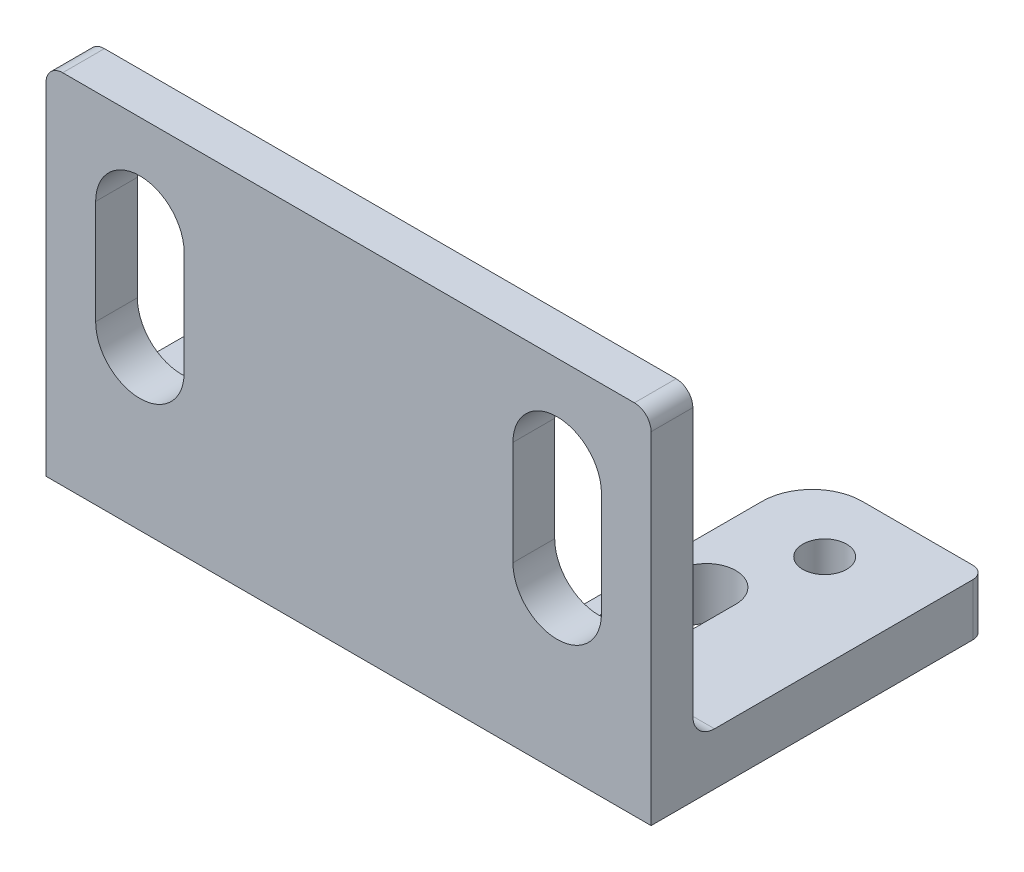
ISO-10303-21;
HEADER;
FILE_DESCRIPTION(('STEP AP214'),'2;1');
FILE_NAME('part.step','',(''),(''),'','','');
FILE_SCHEMA(('AUTOMOTIVE_DESIGN { 1 0 10303 214 1 1 1 1 }'));
ENDSEC;
DATA;
#1=APPLICATION_CONTEXT('core data for automotive mechanical design processes');
#2=APPLICATION_PROTOCOL_DEFINITION('international standard','automotive_design',2000,#1);
#3=PRODUCT_CONTEXT('',#1,'mechanical');
#4=PRODUCT('Part','Part','',(#3));
#5=PRODUCT_RELATED_PRODUCT_CATEGORY('part','',(#4));
#6=PRODUCT_DEFINITION_FORMATION('','',#4);
#7=PRODUCT_DEFINITION_CONTEXT('part definition',#1,'design');
#8=PRODUCT_DEFINITION('design','',#6,#7);
#9=PRODUCT_DEFINITION_SHAPE('','',#8);
#10=(LENGTH_UNIT() NAMED_UNIT(*) SI_UNIT(.MILLI.,.METRE.));
#11=(NAMED_UNIT(*) PLANE_ANGLE_UNIT() SI_UNIT($,.RADIAN.));
#12=(NAMED_UNIT(*) SI_UNIT($,.STERADIAN.) SOLID_ANGLE_UNIT());
#13=UNCERTAINTY_MEASURE_WITH_UNIT(LENGTH_MEASURE(1.E-05),#10,'distance_accuracy_value','');
#14=(GEOMETRIC_REPRESENTATION_CONTEXT(3) GLOBAL_UNCERTAINTY_ASSIGNED_CONTEXT((#13)) GLOBAL_UNIT_ASSIGNED_CONTEXT((#10,
#11,#12)) REPRESENTATION_CONTEXT('',''));
#15=CARTESIAN_POINT('',(0.,0.,0.));
#16=DIRECTION('',(0.,0.,1.));
#17=DIRECTION('',(1.,0.,0.));
#18=AXIS2_PLACEMENT_3D('',#15,#16,#17);
#19=CARTESIAN_POINT('',(0.,3.175,0.));
#20=DIRECTION('',(0.,1.,0.));
#21=DIRECTION('',(0.,0.,1.));
#22=AXIS2_PLACEMENT_3D('',#19,#20,#21);
#23=PLANE('',#22);
#24=CARTESIAN_POINT('',(-12.7,3.175,-12.8524));
#25=DIRECTION('',(0.,1.,0.));
#26=DIRECTION('',(0.,0.,1.));
#27=AXIS2_PLACEMENT_3D('',#24,#25,#26);
#28=CIRCLE('',#27,1.3335);
#29=CARTESIAN_POINT('',(-12.7,3.175,-11.5189));
#30=VERTEX_POINT('',#29);
#31=EDGE_CURVE('E356',#30,#30,#28,.T.);
#32=ORIENTED_EDGE('',*,*,#31,.F.);
#33=EDGE_LOOP('',(#32));
#34=FACE_BOUND('',#33,.T.);
#35=DIRECTION('',(-1.,0.,0.));
#36=VECTOR('',#35,1.);
#37=CARTESIAN_POINT('',(-18.415,3.175,-16.9164));
#38=LINE('',#37,#36);
#39=CARTESIAN_POINT('',(-10.922,3.175,-16.9164));
#40=VERTEX_POINT('',#39);
#41=CARTESIAN_POINT('',(-17.653,3.175,-16.9164));
#42=VERTEX_POINT('',#41);
#43=EDGE_CURVE('E511',#40,#42,#38,.T.);
#44=ORIENTED_EDGE('',*,*,#43,.T.);
#45=CARTESIAN_POINT('',(-17.653,3.175,-16.1544));
#46=DIRECTION('',(0.,1.,0.));
#47=DIRECTION('',(0.,0.,1.));
#48=AXIS2_PLACEMENT_3D('',#45,#46,#47);
#49=CIRCLE('',#48,0.762);
#50=CARTESIAN_POINT('',(-18.415,3.175,-16.1544));
#51=VERTEX_POINT('',#50);
#52=EDGE_CURVE('E550',#42,#51,#49,.T.);
#53=ORIENTED_EDGE('',*,*,#52,.T.);
#54=DIRECTION('',(0.,0.,1.));
#55=VECTOR('',#54,1.);
#56=CARTESIAN_POINT('',(-18.415,3.175,3.429));
#57=LINE('',#56,#55);
#58=CARTESIAN_POINT('',(-18.415,3.175,-0.431799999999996));
#59=VERTEX_POINT('',#58);
#60=EDGE_CURVE('E450',#51,#59,#57,.T.);
#61=ORIENTED_EDGE('',*,*,#60,.T.);
#62=DIRECTION('',(-1.,0.,0.));
#63=VECTOR('',#62,1.);
#64=CARTESIAN_POINT('',(0.,3.175,-0.431799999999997));
#65=LINE('',#64,#63);
#66=CARTESIAN_POINT('',(-7.79874009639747,3.175,-0.431799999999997));
#67=VERTEX_POINT('',#66);
#68=EDGE_CURVE('E380',#59,#67,#65,.F.);
#69=ORIENTED_EDGE('',*,*,#68,.T.);
#70=CARTESIAN_POINT('',(-7.112,3.175,-0.761999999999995));
#71=DIRECTION('',(0.,1.,0.));
#72=DIRECTION('',(0.,0.,1.));
#73=AXIS2_PLACEMENT_3D('',#70,#71,#72);
#74=CIRCLE('',#73,0.762);
#75=CARTESIAN_POINT('',(-7.874,3.175,-0.761999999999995));
#76=VERTEX_POINT('',#75);
#77=EDGE_CURVE('E482',#67,#76,#74,.F.);
#78=ORIENTED_EDGE('',*,*,#77,.T.);
#79=DIRECTION('',(0.,0.,-1.));
#80=VECTOR('',#79,1.);
#81=CARTESIAN_POINT('',(-7.874,3.175,-16.9164));
#82=LINE('',#81,#80);
#83=CARTESIAN_POINT('',(-7.874,3.175,-13.8684));
#84=VERTEX_POINT('',#83);
#85=EDGE_CURVE('E572',#76,#84,#82,.T.);
#86=ORIENTED_EDGE('',*,*,#85,.T.);
#87=CARTESIAN_POINT('',(-10.922,3.175,-13.8684));
#88=DIRECTION('',(0.,1.,0.));
#89=DIRECTION('',(0.,0.,1.));
#90=AXIS2_PLACEMENT_3D('',#87,#88,#89);
#91=CIRCLE('',#90,3.048);
#92=EDGE_CURVE('E419',#84,#40,#91,.T.);
#93=ORIENTED_EDGE('',*,*,#92,.T.);
#94=EDGE_LOOP('',(#44,#53,#61,#69,#78,#86,#93));
#95=FACE_BOUND('',#94,.T.);
#96=ADVANCED_FACE('F32',(#34,#95),#23,.T.);
#97=CARTESIAN_POINT('',(18.415,3.175,3.429));
#98=DIRECTION('',(-1.,0.,0.));
#99=DIRECTION('',(0.,0.,1.));
#100=AXIS2_PLACEMENT_3D('',#97,#98,#99);
#101=PLANE('',#100);
#102=DIRECTION('',(0.,0.,-1.));
#103=VECTOR('',#102,1.);
#104=CARTESIAN_POINT('',(18.415,0.,3.429));
#105=LINE('',#104,#103);
#106=CARTESIAN_POINT('',(18.415,0.,3.429));
#107=VERTEX_POINT('',#106);
#108=CARTESIAN_POINT('',(18.415,0.,-16.1544));
#109=VERTEX_POINT('',#108);
#110=EDGE_CURVE('E364',#107,#109,#105,.T.);
#111=ORIENTED_EDGE('',*,*,#110,.T.);
#112=DIRECTION('',(0.,-1.,0.));
#113=VECTOR('',#112,1.);
#114=CARTESIAN_POINT('',(18.415,3.175,-16.1544));
#115=LINE('',#114,#113);
#116=CARTESIAN_POINT('',(18.415,3.175,-16.1544));
#117=VERTEX_POINT('',#116);
#118=EDGE_CURVE('E40',#109,#117,#115,.F.);
#119=ORIENTED_EDGE('',*,*,#118,.T.);
#120=DIRECTION('',(0.,0.,-1.));
#121=VECTOR('',#120,1.);
#122=CARTESIAN_POINT('',(18.415,3.175,3.429));
#123=LINE('',#122,#121);
#124=CARTESIAN_POINT('',(18.415,3.175,-0.431799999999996));
#125=VERTEX_POINT('',#124);
#126=EDGE_CURVE('E372',#125,#117,#123,.T.);
#127=ORIENTED_EDGE('',*,*,#126,.F.);
#128=CARTESIAN_POINT('',(18.415,4.4958,-0.431799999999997));
#129=DIRECTION('',(-1.,0.,0.));
#130=DIRECTION('',(0.,0.,1.));
#131=AXIS2_PLACEMENT_3D('',#128,#129,#130);
#132=CIRCLE('',#131,1.3208);
#133=CARTESIAN_POINT('',(18.415,4.49580000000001,0.889000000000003));
#134=VERTEX_POINT('',#133);
#135=EDGE_CURVE('E388',#125,#134,#132,.T.);
#136=ORIENTED_EDGE('',*,*,#135,.T.);
#137=DIRECTION('',(0.,-1.,0.));
#138=VECTOR('',#137,1.);
#139=CARTESIAN_POINT('',(18.415,21.7805,0.889000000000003));
#140=LINE('',#139,#138);
#141=CARTESIAN_POINT('',(18.415,20.7645,0.889000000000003));
#142=VERTEX_POINT('',#141);
#143=EDGE_CURVE('E360',#142,#134,#140,.T.);
#144=ORIENTED_EDGE('',*,*,#143,.F.);
#145=DIRECTION('',(0.,0.,-1.));
#146=VECTOR('',#145,1.);
#147=CARTESIAN_POINT('',(18.415,20.7645,3.429));
#148=LINE('',#147,#146);
#149=CARTESIAN_POINT('',(18.415,20.7645,3.429));
#150=VERTEX_POINT('',#149);
#151=EDGE_CURVE('E927',#142,#150,#148,.F.);
#152=ORIENTED_EDGE('',*,*,#151,.T.);
#153=DIRECTION('',(0.,-1.,0.));
#154=VECTOR('',#153,1.);
#155=CARTESIAN_POINT('',(18.415,3.175,3.429));
#156=LINE('',#155,#154);
#157=EDGE_CURVE('E510',#150,#107,#156,.T.);
#158=ORIENTED_EDGE('',*,*,#157,.T.);
#159=EDGE_LOOP('',(#111,#119,#127,#136,#144,#152,#158));
#160=FACE_BOUND('',#159,.T.);
#161=ADVANCED_FACE('F545',(#160),#101,.F.);
#162=CARTESIAN_POINT('',(18.415,3.175,-16.9164));
#163=DIRECTION('',(0.,0.,1.));
#164=DIRECTION('',(1.,0.,0.));
#165=AXIS2_PLACEMENT_3D('',#162,#163,#164);
#166=PLANE('',#165);
#167=DIRECTION('',(-1.,0.,0.));
#168=VECTOR('',#167,1.);
#169=CARTESIAN_POINT('',(18.415,3.175,-16.9164));
#170=LINE('',#169,#168);
#171=CARTESIAN_POINT('',(17.653,3.175,-16.9164));
#172=VERTEX_POINT('',#171);
#173=CARTESIAN_POINT('',(10.922,3.175,-16.9164));
#174=VERTEX_POINT('',#173);
#175=EDGE_CURVE('E369',#172,#174,#170,.T.);
#176=ORIENTED_EDGE('',*,*,#175,.F.);
#177=DIRECTION('',(0.,-1.,0.));
#178=VECTOR('',#177,1.);
#179=CARTESIAN_POINT('',(17.653,3.175,-16.9164));
#180=LINE('',#179,#178);
#181=CARTESIAN_POINT('',(17.653,0.,-16.9164));
#182=VERTEX_POINT('',#181);
#183=EDGE_CURVE('E549',#172,#182,#180,.T.);
#184=ORIENTED_EDGE('',*,*,#183,.T.);
#185=DIRECTION('',(-1.,0.,0.));
#186=VECTOR('',#185,1.);
#187=CARTESIAN_POINT('',(18.415,0.,-16.9164));
#188=LINE('',#187,#186);
#189=CARTESIAN_POINT('',(10.922,0.,-16.9164));
#190=VERTEX_POINT('',#189);
#191=EDGE_CURVE('E518',#182,#190,#188,.T.);
#192=ORIENTED_EDGE('',*,*,#191,.T.);
#193=DIRECTION('',(0.,-1.,0.));
#194=VECTOR('',#193,1.);
#195=CARTESIAN_POINT('',(10.922,3.175,-16.9164));
#196=LINE('',#195,#194);
#197=EDGE_CURVE('E416',#190,#174,#196,.F.);
#198=ORIENTED_EDGE('',*,*,#197,.T.);
#199=EDGE_LOOP('',(#176,#184,#192,#198));
#200=FACE_BOUND('',#199,.T.);
#201=ADVANCED_FACE('F596',(#200),#166,.F.);
#202=CARTESIAN_POINT('',(7.874,3.175,-16.9164));
#203=DIRECTION('',(1.,0.,0.));
#204=DIRECTION('',(0.,0.,-1.));
#205=AXIS2_PLACEMENT_3D('',#202,#203,#204);
#206=PLANE('',#205);
#207=DIRECTION('',(0.,0.,1.));
#208=VECTOR('',#207,1.);
#209=CARTESIAN_POINT('',(7.874,0.,-16.9164));
#210=LINE('',#209,#208);
#211=CARTESIAN_POINT('',(7.874,0.,-13.8684));
#212=VERTEX_POINT('',#211);
#213=CARTESIAN_POINT('',(7.874,0.,-0.761999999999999));
#214=VERTEX_POINT('',#213);
#215=EDGE_CURVE('E520',#212,#214,#210,.T.);
#216=ORIENTED_EDGE('',*,*,#215,.T.);
#217=DIRECTION('',(0.,-1.,0.));
#218=VECTOR('',#217,1.);
#219=CARTESIAN_POINT('',(7.874,3.24757670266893,-0.762));
#220=LINE('',#219,#218);
#221=CARTESIAN_POINT('',(7.874,3.175,-0.761999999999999));
#222=VERTEX_POINT('',#221);
#223=EDGE_CURVE('E471',#214,#222,#220,.F.);
#224=ORIENTED_EDGE('',*,*,#223,.T.);
#225=DIRECTION('',(0.,0.,1.));
#226=VECTOR('',#225,1.);
#227=CARTESIAN_POINT('',(7.874,3.175,-16.9164));
#228=LINE('',#227,#226);
#229=CARTESIAN_POINT('',(7.874,3.175,-13.8684));
#230=VERTEX_POINT('',#229);
#231=EDGE_CURVE('E590',#230,#222,#228,.T.);
#232=ORIENTED_EDGE('',*,*,#231,.F.);
#233=DIRECTION('',(0.,-1.,0.));
#234=VECTOR('',#233,1.);
#235=CARTESIAN_POINT('',(7.874,3.175,-13.8684));
#236=LINE('',#235,#234);
#237=EDGE_CURVE('E406',#230,#212,#236,.T.);
#238=ORIENTED_EDGE('',*,*,#237,.T.);
#239=EDGE_LOOP('',(#216,#224,#232,#238));
#240=FACE_BOUND('',#239,.T.);
#241=ADVANCED_FACE('F586',(#240),#206,.F.);
#242=CARTESIAN_POINT('',(7.874,3.175,0.));
#243=DIRECTION('',(0.,0.,1.));
#244=DIRECTION('',(1.,0.,0.));
#245=AXIS2_PLACEMENT_3D('',#242,#243,#244);
#246=PLANE('',#245);
#247=DIRECTION('',(-1.,0.,0.));
#248=VECTOR('',#247,1.);
#249=CARTESIAN_POINT('',(7.874,0.,0.));
#250=LINE('',#249,#248);
#251=CARTESIAN_POINT('',(7.112,0.,0.));
#252=VERTEX_POINT('',#251);
#253=CARTESIAN_POINT('',(-7.112,0.,0.));
#254=VERTEX_POINT('',#253);
#255=EDGE_CURVE('E523',#252,#254,#250,.T.);
#256=ORIENTED_EDGE('',*,*,#255,.T.);
#257=DIRECTION('',(0.,-1.,0.));
#258=VECTOR('',#257,1.);
#259=CARTESIAN_POINT('',(-7.112,3.24757670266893,0.));
#260=LINE('',#259,#258);
#261=CARTESIAN_POINT('',(-7.112,3.24757670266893,0.));
#262=VERTEX_POINT('',#261);
#263=EDGE_CURVE('E469',#254,#262,#260,.F.);
#264=ORIENTED_EDGE('',*,*,#263,.T.);
#265=DIRECTION('',(-1.,0.,0.));
#266=VECTOR('',#265,1.);
#267=CARTESIAN_POINT('',(-7.874,3.24757670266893,0.));
#268=LINE('',#267,#266);
#269=CARTESIAN_POINT('',(7.112,3.24757670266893,0.));
#270=VERTEX_POINT('',#269);
#271=EDGE_CURVE('E385',#262,#270,#268,.F.);
#272=ORIENTED_EDGE('',*,*,#271,.T.);
#273=DIRECTION('',(0.,-1.,0.));
#274=VECTOR('',#273,1.);
#275=CARTESIAN_POINT('',(7.112,0.,0.));
#276=LINE('',#275,#274);
#277=EDGE_CURVE('E461',#270,#252,#276,.T.);
#278=ORIENTED_EDGE('',*,*,#277,.T.);
#279=EDGE_LOOP('',(#256,#264,#272,#278));
#280=FACE_BOUND('',#279,.T.);
#281=ADVANCED_FACE('F577',(#280),#246,.F.);
#282=CARTESIAN_POINT('',(-7.874,3.175,-16.9164));
#283=DIRECTION('',(-1.,0.,0.));
#284=DIRECTION('',(0.,0.,1.));
#285=AXIS2_PLACEMENT_3D('',#282,#283,#284);
#286=PLANE('',#285);
#287=ORIENTED_EDGE('',*,*,#85,.F.);
#288=DIRECTION('',(0.,-1.,0.));
#289=VECTOR('',#288,1.);
#290=CARTESIAN_POINT('',(-7.874,0.,-0.761999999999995));
#291=LINE('',#290,#289);
#292=CARTESIAN_POINT('',(-7.874,0.,-0.761999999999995));
#293=VERTEX_POINT('',#292);
#294=EDGE_CURVE('E457',#76,#293,#291,.T.);
#295=ORIENTED_EDGE('',*,*,#294,.T.);
#296=DIRECTION('',(0.,0.,-1.));
#297=VECTOR('',#296,1.);
#298=CARTESIAN_POINT('',(-7.874,0.,-16.9164));
#299=LINE('',#298,#297);
#300=CARTESIAN_POINT('',(-7.874,0.,-13.8684));
#301=VERTEX_POINT('',#300);
#302=EDGE_CURVE('E526',#293,#301,#299,.T.);
#303=ORIENTED_EDGE('',*,*,#302,.T.);
#304=DIRECTION('',(0.,-1.,0.));
#305=VECTOR('',#304,1.);
#306=CARTESIAN_POINT('',(-7.874,3.175,-13.8684));
#307=LINE('',#306,#305);
#308=EDGE_CURVE('E425',#301,#84,#307,.F.);
#309=ORIENTED_EDGE('',*,*,#308,.T.);
#310=EDGE_LOOP('',(#287,#295,#303,#309));
#311=FACE_BOUND('',#310,.T.);
#312=ADVANCED_FACE('F570',(#311),#286,.F.);
#313=CARTESIAN_POINT('',(-18.415,3.175,-16.9164));
#314=DIRECTION('',(0.,0.,1.));
#315=DIRECTION('',(1.,0.,0.));
#316=AXIS2_PLACEMENT_3D('',#313,#314,#315);
#317=PLANE('',#316);
#318=DIRECTION('',(-1.,0.,0.));
#319=VECTOR('',#318,1.);
#320=CARTESIAN_POINT('',(-18.415,0.,-16.9164));
#321=LINE('',#320,#319);
#322=CARTESIAN_POINT('',(-10.922,0.,-16.9164));
#323=VERTEX_POINT('',#322);
#324=CARTESIAN_POINT('',(-17.653,0.,-16.9164));
#325=VERTEX_POINT('',#324);
#326=EDGE_CURVE('E528',#323,#325,#321,.T.);
#327=ORIENTED_EDGE('',*,*,#326,.T.);
#328=DIRECTION('',(0.,-1.,0.));
#329=VECTOR('',#328,1.);
#330=CARTESIAN_POINT('',(-17.653,3.175,-16.9164));
#331=LINE('',#330,#329);
#332=EDGE_CURVE('E554',#325,#42,#331,.F.);
#333=ORIENTED_EDGE('',*,*,#332,.T.);
#334=ORIENTED_EDGE('',*,*,#43,.F.);
#335=DIRECTION('',(0.,-1.,0.));
#336=VECTOR('',#335,1.);
#337=CARTESIAN_POINT('',(-10.922,3.175,-16.9164));
#338=LINE('',#337,#336);
#339=EDGE_CURVE('E423',#40,#323,#338,.T.);
#340=ORIENTED_EDGE('',*,*,#339,.T.);
#341=EDGE_LOOP('',(#327,#333,#334,#340));
#342=FACE_BOUND('',#341,.T.);
#343=ADVANCED_FACE('F562',(#342),#317,.F.);
#344=CARTESIAN_POINT('',(-18.415,3.175,3.429));
#345=DIRECTION('',(1.,0.,0.));
#346=DIRECTION('',(0.,0.,-1.));
#347=AXIS2_PLACEMENT_3D('',#344,#345,#346);
#348=PLANE('',#347);
#349=ORIENTED_EDGE('',*,*,#60,.F.);
#350=DIRECTION('',(0.,-1.,0.));
#351=VECTOR('',#350,1.);
#352=CARTESIAN_POINT('',(-18.415,3.175,-16.1544));
#353=LINE('',#352,#351);
#354=CARTESIAN_POINT('',(-18.415,0.,-16.1544));
#355=VERTEX_POINT('',#354);
#356=EDGE_CURVE('E506',#51,#355,#353,.T.);
#357=ORIENTED_EDGE('',*,*,#356,.T.);
#358=DIRECTION('',(0.,0.,1.));
#359=VECTOR('',#358,1.);
#360=CARTESIAN_POINT('',(-18.415,0.,3.429));
#361=LINE('',#360,#359);
#362=CARTESIAN_POINT('',(-18.415,0.,3.429));
#363=VERTEX_POINT('',#362);
#364=EDGE_CURVE('E531',#355,#363,#361,.T.);
#365=ORIENTED_EDGE('',*,*,#364,.T.);
#366=DIRECTION('',(0.,-1.,0.));
#367=VECTOR('',#366,1.);
#368=CARTESIAN_POINT('',(-18.415,3.175,3.429));
#369=LINE('',#368,#367);
#370=CARTESIAN_POINT('',(-18.415,20.7645,3.429));
#371=VERTEX_POINT('',#370);
#372=EDGE_CURVE('E410',#371,#363,#369,.T.);
#373=ORIENTED_EDGE('',*,*,#372,.F.);
#374=DIRECTION('',(0.,0.,1.));
#375=VECTOR('',#374,1.);
#376=CARTESIAN_POINT('',(-18.415,20.7645,3.429));
#377=LINE('',#376,#375);
#378=CARTESIAN_POINT('',(-18.415,20.7645,0.889000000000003));
#379=VERTEX_POINT('',#378);
#380=EDGE_CURVE('E454',#371,#379,#377,.F.);
#381=ORIENTED_EDGE('',*,*,#380,.T.);
#382=DIRECTION('',(0.,-1.,0.));
#383=VECTOR('',#382,1.);
#384=CARTESIAN_POINT('',(-18.415,21.7805,0.889000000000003));
#385=LINE('',#384,#383);
#386=CARTESIAN_POINT('',(-18.415,4.49580000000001,0.889000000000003));
#387=VERTEX_POINT('',#386);
#388=EDGE_CURVE('E352',#379,#387,#385,.T.);
#389=ORIENTED_EDGE('',*,*,#388,.T.);
#390=CARTESIAN_POINT('',(-18.415,4.4958,-0.431799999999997));
#391=DIRECTION('',(1.,0.,0.));
#392=DIRECTION('',(0.,0.,-1.));
#393=AXIS2_PLACEMENT_3D('',#390,#391,#392);
#394=CIRCLE('',#393,1.3208);
#395=EDGE_CURVE('E382',#387,#59,#394,.T.);
#396=ORIENTED_EDGE('',*,*,#395,.T.);
#397=EDGE_LOOP('',(#349,#357,#365,#373,#381,#389,#396));
#398=FACE_BOUND('',#397,.T.);
#399=ADVANCED_FACE('F448',(#398),#348,.F.);
#400=CARTESIAN_POINT('',(-18.415,3.175,3.429));
#401=DIRECTION('',(0.,0.,-1.));
#402=DIRECTION('',(-1.,0.,0.));
#403=AXIS2_PLACEMENT_3D('',#400,#401,#402);
#404=PLANE('',#403);
#405=DIRECTION('',(0.,-1.,0.));
#406=VECTOR('',#405,1.);
#407=CARTESIAN_POINT('',(15.3924,9.652,3.429));
#408=LINE('',#407,#406);
#409=CARTESIAN_POINT('',(15.3924,16.002,3.429));
#410=VERTEX_POINT('',#409);
#411=CARTESIAN_POINT('',(15.3924,9.652,3.429));
#412=VERTEX_POINT('',#411);
#413=EDGE_CURVE('E293',#410,#412,#408,.T.);
#414=ORIENTED_EDGE('',*,*,#413,.T.);
#415=CARTESIAN_POINT('',(12.7,9.652,3.429));
#416=DIRECTION('',(0.,0.,-1.));
#417=DIRECTION('',(1.,0.,0.));
#418=AXIS2_PLACEMENT_3D('',#415,#416,#417);
#419=CIRCLE('',#418,2.6924);
#420=CARTESIAN_POINT('',(10.0076,9.652,3.429));
#421=VERTEX_POINT('',#420);
#422=EDGE_CURVE('E283',#412,#421,#419,.T.);
#423=ORIENTED_EDGE('',*,*,#422,.T.);
#424=DIRECTION('',(0.,1.,0.));
#425=VECTOR('',#424,1.);
#426=CARTESIAN_POINT('',(10.0076,9.652,3.429));
#427=LINE('',#426,#425);
#428=CARTESIAN_POINT('',(10.0076,16.002,3.429));
#429=VERTEX_POINT('',#428);
#430=EDGE_CURVE('E286',#421,#429,#427,.T.);
#431=ORIENTED_EDGE('',*,*,#430,.T.);
#432=CARTESIAN_POINT('',(12.7,16.002,3.429));
#433=DIRECTION('',(0.,0.,-1.));
#434=DIRECTION('',(1.,0.,0.));
#435=AXIS2_PLACEMENT_3D('',#432,#433,#434);
#436=CIRCLE('',#435,2.6924);
#437=EDGE_CURVE('E290',#429,#410,#436,.T.);
#438=ORIENTED_EDGE('',*,*,#437,.T.);
#439=EDGE_LOOP('',(#414,#423,#431,#438));
#440=FACE_BOUND('',#439,.T.);
#441=DIRECTION('',(0.,-1.,0.));
#442=VECTOR('',#441,1.);
#443=CARTESIAN_POINT('',(-10.0076,9.652,3.429));
#444=LINE('',#443,#442);
#445=CARTESIAN_POINT('',(-10.0076,16.002,3.429));
#446=VERTEX_POINT('',#445);
#447=CARTESIAN_POINT('',(-10.0076,9.652,3.429));
#448=VERTEX_POINT('',#447);
#449=EDGE_CURVE('E325',#446,#448,#444,.T.);
#450=ORIENTED_EDGE('',*,*,#449,.T.);
#451=CARTESIAN_POINT('',(-12.7,9.652,3.429));
#452=DIRECTION('',(0.,0.,-1.));
#453=DIRECTION('',(-1.,0.,0.));
#454=AXIS2_PLACEMENT_3D('',#451,#452,#453);
#455=CIRCLE('',#454,2.6924);
#456=CARTESIAN_POINT('',(-15.3924,9.652,3.429));
#457=VERTEX_POINT('',#456);
#458=EDGE_CURVE('E315',#448,#457,#455,.T.);
#459=ORIENTED_EDGE('',*,*,#458,.T.);
#460=DIRECTION('',(0.,1.,0.));
#461=VECTOR('',#460,1.);
#462=CARTESIAN_POINT('',(-15.3924,9.652,3.429));
#463=LINE('',#462,#461);
#464=CARTESIAN_POINT('',(-15.3924,16.002,3.429));
#465=VERTEX_POINT('',#464);
#466=EDGE_CURVE('E318',#457,#465,#463,.T.);
#467=ORIENTED_EDGE('',*,*,#466,.T.);
#468=CARTESIAN_POINT('',(-12.7,16.002,3.429));
#469=DIRECTION('',(0.,0.,-1.));
#470=DIRECTION('',(-1.,0.,0.));
#471=AXIS2_PLACEMENT_3D('',#468,#469,#470);
#472=CIRCLE('',#471,2.6924);
#473=EDGE_CURVE('E322',#465,#446,#472,.T.);
#474=ORIENTED_EDGE('',*,*,#473,.T.);
#475=EDGE_LOOP('',(#450,#459,#467,#474));
#476=FACE_BOUND('',#475,.T.);
#477=ORIENTED_EDGE('',*,*,#157,.F.);
#478=CARTESIAN_POINT('',(17.399,20.7645,3.429));
#479=DIRECTION('',(0.,0.,-1.));
#480=DIRECTION('',(-1.,0.,0.));
#481=AXIS2_PLACEMENT_3D('',#478,#479,#480);
#482=CIRCLE('',#481,1.016);
#483=CARTESIAN_POINT('',(17.399,21.7805,3.429));
#484=VERTEX_POINT('',#483);
#485=EDGE_CURVE('E458',#150,#484,#482,.F.);
#486=ORIENTED_EDGE('',*,*,#485,.T.);
#487=DIRECTION('',(1.,0.,0.));
#488=VECTOR('',#487,1.);
#489=CARTESIAN_POINT('',(-18.415,21.7805,3.429));
#490=LINE('',#489,#488);
#491=CARTESIAN_POINT('',(-17.399,21.7805,3.429));
#492=VERTEX_POINT('',#491);
#493=EDGE_CURVE('E340',#492,#484,#490,.T.);
#494=ORIENTED_EDGE('',*,*,#493,.F.);
#495=CARTESIAN_POINT('',(-17.399,20.7645,3.429));
#496=DIRECTION('',(0.,0.,-1.));
#497=DIRECTION('',(-1.,0.,0.));
#498=AXIS2_PLACEMENT_3D('',#495,#496,#497);
#499=CIRCLE('',#498,1.016);
#500=EDGE_CURVE('E463',#492,#371,#499,.F.);
#501=ORIENTED_EDGE('',*,*,#500,.T.);
#502=ORIENTED_EDGE('',*,*,#372,.T.);
#503=DIRECTION('',(1.,0.,0.));
#504=VECTOR('',#503,1.);
#505=CARTESIAN_POINT('',(-18.415,0.,3.429));
#506=LINE('',#505,#504);
#507=EDGE_CURVE('E375',#363,#107,#506,.T.);
#508=ORIENTED_EDGE('',*,*,#507,.T.);
#509=EDGE_LOOP('',(#477,#486,#494,#501,#502,#508));
#510=FACE_BOUND('',#509,.T.);
#511=ADVANCED_FACE('F538',(#440,#476,#510),#404,.F.);
#512=CARTESIAN_POINT('',(10.7188,3.175,-2.3114));
#513=DIRECTION('',(0.,1.,0.));
#514=DIRECTION('',(0.,0.,1.));
#515=AXIS2_PLACEMENT_3D('',#512,#513,#514);
#516=CIRCLE('',#515,1.778);
#517=CARTESIAN_POINT('',(8.9408,3.175,-2.3114));
#518=VERTEX_POINT('',#517);
#519=CARTESIAN_POINT('',(12.4968,3.175,-2.3114));
#520=VERTEX_POINT('',#519);
#521=EDGE_CURVE('E280',#518,#520,#516,.T.);
#522=ORIENTED_EDGE('',*,*,#521,.F.);
#523=DIRECTION('',(0.,0.,1.));
#524=VECTOR('',#523,1.);
#525=CARTESIAN_POINT('',(8.9408,3.175,0.));
#526=LINE('',#525,#524);
#527=CARTESIAN_POINT('',(8.9408,3.175,-7.6454));
#528=VERTEX_POINT('',#527);
#529=EDGE_CURVE('E273',#528,#518,#526,.T.);
#530=ORIENTED_EDGE('',*,*,#529,.F.);
#531=CARTESIAN_POINT('',(10.7188,3.175,-7.6454));
#532=DIRECTION('',(0.,1.,0.));
#533=DIRECTION('',(0.,0.,1.));
#534=AXIS2_PLACEMENT_3D('',#531,#532,#533);
#535=CIRCLE('',#534,1.778);
#536=CARTESIAN_POINT('',(12.4968,3.175,-7.6454));
#537=VERTEX_POINT('',#536);
#538=EDGE_CURVE('E248',#537,#528,#535,.T.);
#539=ORIENTED_EDGE('',*,*,#538,.F.);
#540=DIRECTION('',(0.,0.,-1.));
#541=VECTOR('',#540,1.);
#542=CARTESIAN_POINT('',(12.4968,3.175,0.));
#543=LINE('',#542,#541);
#544=EDGE_CURVE('E278',#520,#537,#543,.T.);
#545=ORIENTED_EDGE('',*,*,#544,.F.);
#546=EDGE_LOOP('',(#522,#530,#539,#545));
#547=FACE_BOUND('',#546,.T.);
#548=ORIENTED_EDGE('',*,*,#126,.T.);
#549=CARTESIAN_POINT('',(17.653,3.175,-16.1544));
#550=DIRECTION('',(0.,1.,0.));
#551=DIRECTION('',(0.,0.,1.));
#552=AXIS2_PLACEMENT_3D('',#549,#550,#551);
#553=CIRCLE('',#552,0.762);
#554=EDGE_CURVE('E11',#117,#172,#553,.T.);
#555=ORIENTED_EDGE('',*,*,#554,.T.);
#556=ORIENTED_EDGE('',*,*,#175,.T.);
#557=CARTESIAN_POINT('',(10.922,3.175,-13.8684));
#558=DIRECTION('',(0.,1.,0.));
#559=DIRECTION('',(0.,0.,1.));
#560=AXIS2_PLACEMENT_3D('',#557,#558,#559);
#561=CIRCLE('',#560,3.048);
#562=EDGE_CURVE('E421',#174,#230,#561,.T.);
#563=ORIENTED_EDGE('',*,*,#562,.T.);
#564=ORIENTED_EDGE('',*,*,#231,.T.);
#565=CARTESIAN_POINT('',(7.112,3.175,-0.762));
#566=DIRECTION('',(0.,1.,0.));
#567=DIRECTION('',(0.,0.,1.));
#568=AXIS2_PLACEMENT_3D('',#565,#566,#567);
#569=CIRCLE('',#568,0.762);
#570=CARTESIAN_POINT('',(7.79874009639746,3.175,-0.431799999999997));
#571=VERTEX_POINT('',#570);
#572=EDGE_CURVE('E507',#222,#571,#569,.F.);
#573=ORIENTED_EDGE('',*,*,#572,.T.);
#574=DIRECTION('',(-1.,0.,0.));
#575=VECTOR('',#574,1.);
#576=CARTESIAN_POINT('',(0.,3.175,-0.431799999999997));
#577=LINE('',#576,#575);
#578=EDGE_CURVE('E378',#571,#125,#577,.F.);
#579=ORIENTED_EDGE('',*,*,#578,.T.);
#580=EDGE_LOOP('',(#548,#555,#556,#563,#564,#573,#579));
#581=FACE_BOUND('',#580,.T.);
#582=CARTESIAN_POINT('',(12.7,3.175,-12.8524));
#583=DIRECTION('',(0.,1.,0.));
#584=DIRECTION('',(0.,0.,-1.));
#585=AXIS2_PLACEMENT_3D('',#582,#583,#584);
#586=CIRCLE('',#585,1.3335);
#587=CARTESIAN_POINT('',(12.7,3.175,-14.1859));
#588=VERTEX_POINT('',#587);
#589=EDGE_CURVE('E357',#588,#588,#586,.T.);
#590=ORIENTED_EDGE('',*,*,#589,.F.);
#591=EDGE_LOOP('',(#590));
#592=FACE_BOUND('',#591,.T.);
#593=ADVANCED_FACE('F601',(#547,#581,#592),#23,.T.);
#594=CARTESIAN_POINT('',(0.,0.,0.));
#595=DIRECTION('',(0.,1.,0.));
#596=DIRECTION('',(0.,0.,1.));
#597=AXIS2_PLACEMENT_3D('',#594,#595,#596);
#598=PLANE('',#597);
#599=DIRECTION('',(0.,0.,-1.));
#600=VECTOR('',#599,1.);
#601=CARTESIAN_POINT('',(8.9408,0.,-2.3114));
#602=LINE('',#601,#600);
#603=CARTESIAN_POINT('',(8.9408,0.,-2.3114));
#604=VERTEX_POINT('',#603);
#605=CARTESIAN_POINT('',(8.9408,0.,-7.6454));
#606=VERTEX_POINT('',#605);
#607=EDGE_CURVE('E256',#604,#606,#602,.T.);
#608=ORIENTED_EDGE('',*,*,#607,.F.);
#609=CARTESIAN_POINT('',(10.7188,0.,-2.3114));
#610=DIRECTION('',(0.,-1.,0.));
#611=DIRECTION('',(0.,0.,-1.));
#612=AXIS2_PLACEMENT_3D('',#609,#610,#611);
#613=CIRCLE('',#612,1.778);
#614=CARTESIAN_POINT('',(12.4968,0.,-2.3114));
#615=VERTEX_POINT('',#614);
#616=EDGE_CURVE('E261',#615,#604,#613,.T.);
#617=ORIENTED_EDGE('',*,*,#616,.F.);
#618=DIRECTION('',(0.,0.,1.));
#619=VECTOR('',#618,1.);
#620=CARTESIAN_POINT('',(12.4968,0.,-2.3114));
#621=LINE('',#620,#619);
#622=CARTESIAN_POINT('',(12.4968,0.,-7.6454));
#623=VERTEX_POINT('',#622);
#624=EDGE_CURVE('E266',#623,#615,#621,.T.);
#625=ORIENTED_EDGE('',*,*,#624,.F.);
#626=CARTESIAN_POINT('',(10.7188,0.,-7.6454));
#627=DIRECTION('',(0.,-1.,0.));
#628=DIRECTION('',(0.,0.,-1.));
#629=AXIS2_PLACEMENT_3D('',#626,#627,#628);
#630=CIRCLE('',#629,1.778);
#631=EDGE_CURVE('E245',#606,#623,#630,.T.);
#632=ORIENTED_EDGE('',*,*,#631,.F.);
#633=EDGE_LOOP('',(#608,#617,#625,#632));
#634=FACE_BOUND('',#633,.T.);
#635=CARTESIAN_POINT('',(12.7,0.,-12.8524));
#636=DIRECTION('',(0.,1.,0.));
#637=DIRECTION('',(0.,0.,-1.));
#638=AXIS2_PLACEMENT_3D('',#635,#636,#637);
#639=CIRCLE('',#638,1.3335);
#640=CARTESIAN_POINT('',(12.7,0.,-14.1859));
#641=VERTEX_POINT('',#640);
#642=EDGE_CURVE('E353',#641,#641,#639,.T.);
#643=ORIENTED_EDGE('',*,*,#642,.T.);
#644=EDGE_LOOP('',(#643));
#645=FACE_BOUND('',#644,.T.);
#646=CARTESIAN_POINT('',(-12.7,0.,-12.8524));
#647=DIRECTION('',(0.,1.,0.));
#648=DIRECTION('',(0.,0.,1.));
#649=AXIS2_PLACEMENT_3D('',#646,#647,#648);
#650=CIRCLE('',#649,1.3335);
#651=CARTESIAN_POINT('',(-12.7,0.,-11.5189));
#652=VERTEX_POINT('',#651);
#653=EDGE_CURVE('E361',#652,#652,#650,.T.);
#654=ORIENTED_EDGE('',*,*,#653,.T.);
#655=EDGE_LOOP('',(#654));
#656=FACE_BOUND('',#655,.T.);
#657=ORIENTED_EDGE('',*,*,#364,.F.);
#658=CARTESIAN_POINT('',(-17.653,0.,-16.1544));
#659=DIRECTION('',(0.,1.,0.));
#660=DIRECTION('',(0.,0.,1.));
#661=AXIS2_PLACEMENT_3D('',#658,#659,#660);
#662=CIRCLE('',#661,0.762);
#663=EDGE_CURVE('E556',#355,#325,#662,.F.);
#664=ORIENTED_EDGE('',*,*,#663,.T.);
#665=ORIENTED_EDGE('',*,*,#326,.F.);
#666=CARTESIAN_POINT('',(-10.922,0.,-13.8684));
#667=DIRECTION('',(0.,1.,0.));
#668=DIRECTION('',(0.,0.,1.));
#669=AXIS2_PLACEMENT_3D('',#666,#667,#668);
#670=CIRCLE('',#669,3.048);
#671=EDGE_CURVE('E409',#323,#301,#670,.F.);
#672=ORIENTED_EDGE('',*,*,#671,.T.);
#673=ORIENTED_EDGE('',*,*,#302,.F.);
#674=CARTESIAN_POINT('',(-7.112,0.,-0.761999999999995));
#675=DIRECTION('',(0.,1.,0.));
#676=DIRECTION('',(0.,0.,1.));
#677=AXIS2_PLACEMENT_3D('',#674,#675,#676);
#678=CIRCLE('',#677,0.762);
#679=EDGE_CURVE('E473',#293,#254,#678,.T.);
#680=ORIENTED_EDGE('',*,*,#679,.T.);
#681=ORIENTED_EDGE('',*,*,#255,.F.);
#682=CARTESIAN_POINT('',(7.112,0.,-0.762));
#683=DIRECTION('',(0.,1.,0.));
#684=DIRECTION('',(0.,0.,1.));
#685=AXIS2_PLACEMENT_3D('',#682,#683,#684);
#686=CIRCLE('',#685,0.762);
#687=EDGE_CURVE('E583',#252,#214,#686,.T.);
#688=ORIENTED_EDGE('',*,*,#687,.T.);
#689=ORIENTED_EDGE('',*,*,#215,.F.);
#690=CARTESIAN_POINT('',(10.922,0.,-13.8684));
#691=DIRECTION('',(0.,1.,0.));
#692=DIRECTION('',(0.,0.,1.));
#693=AXIS2_PLACEMENT_3D('',#690,#691,#692);
#694=CIRCLE('',#693,3.048);
#695=EDGE_CURVE('E413',#212,#190,#694,.F.);
#696=ORIENTED_EDGE('',*,*,#695,.T.);
#697=ORIENTED_EDGE('',*,*,#191,.F.);
#698=CARTESIAN_POINT('',(17.653,0.,-16.1544));
#699=DIRECTION('',(0.,1.,0.));
#700=DIRECTION('',(0.,0.,1.));
#701=AXIS2_PLACEMENT_3D('',#698,#699,#700);
#702=CIRCLE('',#701,0.762);
#703=EDGE_CURVE('E544',#182,#109,#702,.F.);
#704=ORIENTED_EDGE('',*,*,#703,.T.);
#705=ORIENTED_EDGE('',*,*,#110,.F.);
#706=ORIENTED_EDGE('',*,*,#507,.F.);
#707=EDGE_LOOP('',(#657,#664,#665,#672,#673,#680,#681,#688,#689,#696,#697,#704,#705,#706));
#708=FACE_BOUND('',#707,.T.);
#709=ADVANCED_FACE('F263',(#634,#645,#656,#708),#598,.F.);
#710=CARTESIAN_POINT('',(-12.7,0.,-12.8524));
#711=DIRECTION('',(0.,1.,0.));
#712=DIRECTION('',(0.,0.,1.));
#713=AXIS2_PLACEMENT_3D('',#710,#711,#712);
#714=CYLINDRICAL_SURFACE('',#713,1.3335);
#715=ORIENTED_EDGE('',*,*,#653,.F.);
#716=EDGE_LOOP('',(#715));
#717=FACE_BOUND('',#716,.T.);
#718=ORIENTED_EDGE('',*,*,#31,.T.);
#719=EDGE_LOOP('',(#718));
#720=FACE_BOUND('',#719,.T.);
#721=ADVANCED_FACE('F615',(#717,#720),#714,.F.);
#722=CARTESIAN_POINT('',(12.7,0.,-12.8524));
#723=DIRECTION('',(0.,1.,0.));
#724=DIRECTION('',(0.,0.,1.));
#725=AXIS2_PLACEMENT_3D('',#722,#723,#724);
#726=CYLINDRICAL_SURFACE('',#725,1.3335);
#727=ORIENTED_EDGE('',*,*,#642,.F.);
#728=EDGE_LOOP('',(#727));
#729=FACE_BOUND('',#728,.T.);
#730=ORIENTED_EDGE('',*,*,#589,.T.);
#731=EDGE_LOOP('',(#730));
#732=FACE_BOUND('',#731,.T.);
#733=ADVANCED_FACE('F623',(#729,#732),#726,.F.);
#734=CARTESIAN_POINT('',(-18.415,21.7805,0.889000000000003));
#735=DIRECTION('',(0.,0.,1.));
#736=DIRECTION('',(1.,0.,0.));
#737=AXIS2_PLACEMENT_3D('',#734,#735,#736);
#738=PLANE('',#737);
#739=DIRECTION('',(0.,1.,0.));
#740=VECTOR('',#739,1.);
#741=CARTESIAN_POINT('',(10.0076,9.652,0.889000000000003));
#742=LINE('',#741,#740);
#743=CARTESIAN_POINT('',(10.0076,9.652,0.889000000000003));
#744=VERTEX_POINT('',#743);
#745=CARTESIAN_POINT('',(10.0076,16.002,0.889000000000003));
#746=VERTEX_POINT('',#745);
#747=EDGE_CURVE('E298',#744,#746,#742,.T.);
#748=ORIENTED_EDGE('',*,*,#747,.F.);
#749=CARTESIAN_POINT('',(12.7,9.652,0.889000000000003));
#750=DIRECTION('',(0.,0.,-1.));
#751=DIRECTION('',(1.,0.,0.));
#752=AXIS2_PLACEMENT_3D('',#749,#750,#751);
#753=CIRCLE('',#752,2.6924);
#754=CARTESIAN_POINT('',(15.3924,9.652,0.889000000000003));
#755=VERTEX_POINT('',#754);
#756=EDGE_CURVE('E282',#755,#744,#753,.T.);
#757=ORIENTED_EDGE('',*,*,#756,.F.);
#758=DIRECTION('',(0.,-1.,0.));
#759=VECTOR('',#758,1.);
#760=CARTESIAN_POINT('',(15.3924,9.652,0.889000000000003));
#761=LINE('',#760,#759);
#762=CARTESIAN_POINT('',(15.3924,16.002,0.889000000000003));
#763=VERTEX_POINT('',#762);
#764=EDGE_CURVE('E287',#763,#755,#761,.T.);
#765=ORIENTED_EDGE('',*,*,#764,.F.);
#766=CARTESIAN_POINT('',(12.7,16.002,0.889000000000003));
#767=DIRECTION('',(0.,0.,-1.));
#768=DIRECTION('',(1.,0.,0.));
#769=AXIS2_PLACEMENT_3D('',#766,#767,#768);
#770=CIRCLE('',#769,2.6924);
#771=EDGE_CURVE('E301',#746,#763,#770,.T.);
#772=ORIENTED_EDGE('',*,*,#771,.F.);
#773=EDGE_LOOP('',(#748,#757,#765,#772));
#774=FACE_BOUND('',#773,.T.);
#775=DIRECTION('',(0.,1.,0.));
#776=VECTOR('',#775,1.);
#777=CARTESIAN_POINT('',(-15.3924,9.652,0.889000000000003));
#778=LINE('',#777,#776);
#779=CARTESIAN_POINT('',(-15.3924,9.652,0.889000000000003));
#780=VERTEX_POINT('',#779);
#781=CARTESIAN_POINT('',(-15.3924,16.002,0.889000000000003));
#782=VERTEX_POINT('',#781);
#783=EDGE_CURVE('E330',#780,#782,#778,.T.);
#784=ORIENTED_EDGE('',*,*,#783,.F.);
#785=CARTESIAN_POINT('',(-12.7,9.652,0.889000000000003));
#786=DIRECTION('',(0.,0.,-1.));
#787=DIRECTION('',(-1.,0.,0.));
#788=AXIS2_PLACEMENT_3D('',#785,#786,#787);
#789=CIRCLE('',#788,2.6924);
#790=CARTESIAN_POINT('',(-10.0076,9.652,0.889000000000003));
#791=VERTEX_POINT('',#790);
#792=EDGE_CURVE('E308',#791,#780,#789,.T.);
#793=ORIENTED_EDGE('',*,*,#792,.F.);
#794=DIRECTION('',(0.,-1.,0.));
#795=VECTOR('',#794,1.);
#796=CARTESIAN_POINT('',(-10.0076,9.652,0.889000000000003));
#797=LINE('',#796,#795);
#798=CARTESIAN_POINT('',(-10.0076,16.002,0.889000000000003));
#799=VERTEX_POINT('',#798);
#800=EDGE_CURVE('E319',#799,#791,#797,.T.);
#801=ORIENTED_EDGE('',*,*,#800,.F.);
#802=CARTESIAN_POINT('',(-12.7,16.002,0.889000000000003));
#803=DIRECTION('',(0.,0.,-1.));
#804=DIRECTION('',(-1.,0.,0.));
#805=AXIS2_PLACEMENT_3D('',#802,#803,#804);
#806=CIRCLE('',#805,2.6924);
#807=EDGE_CURVE('E333',#782,#799,#806,.T.);
#808=ORIENTED_EDGE('',*,*,#807,.F.);
#809=EDGE_LOOP('',(#784,#793,#801,#808));
#810=FACE_BOUND('',#809,.T.);
#811=DIRECTION('',(-1.,0.,0.));
#812=VECTOR('',#811,1.);
#813=CARTESIAN_POINT('',(-18.415,21.7805,0.889000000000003));
#814=LINE('',#813,#812);
#815=CARTESIAN_POINT('',(17.399,21.7805,0.889000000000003));
#816=VERTEX_POINT('',#815);
#817=CARTESIAN_POINT('',(-17.399,21.7805,0.889000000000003));
#818=VERTEX_POINT('',#817);
#819=EDGE_CURVE('E349',#816,#818,#814,.T.);
#820=ORIENTED_EDGE('',*,*,#819,.F.);
#821=CARTESIAN_POINT('',(17.399,20.7645,0.889000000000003));
#822=DIRECTION('',(0.,0.,1.));
#823=DIRECTION('',(1.,0.,0.));
#824=AXIS2_PLACEMENT_3D('',#821,#822,#823);
#825=CIRCLE('',#824,1.016);
#826=EDGE_CURVE('E926',#816,#142,#825,.F.);
#827=ORIENTED_EDGE('',*,*,#826,.T.);
#828=ORIENTED_EDGE('',*,*,#143,.T.);
#829=DIRECTION('',(-1.,0.,0.));
#830=VECTOR('',#829,1.);
#831=CARTESIAN_POINT('',(-18.415,4.4958,0.889000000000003));
#832=LINE('',#831,#830);
#833=EDGE_CURVE('E376',#134,#387,#832,.T.);
#834=ORIENTED_EDGE('',*,*,#833,.T.);
#835=ORIENTED_EDGE('',*,*,#388,.F.);
#836=CARTESIAN_POINT('',(-17.399,20.7645,0.889000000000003));
#837=DIRECTION('',(0.,0.,1.));
#838=DIRECTION('',(1.,0.,0.));
#839=AXIS2_PLACEMENT_3D('',#836,#837,#838);
#840=CIRCLE('',#839,1.016);
#841=EDGE_CURVE('E397',#379,#818,#840,.F.);
#842=ORIENTED_EDGE('',*,*,#841,.T.);
#843=EDGE_LOOP('',(#820,#827,#828,#834,#835,#842));
#844=FACE_BOUND('',#843,.T.);
#845=ADVANCED_FACE('F436',(#774,#810,#844),#738,.F.);
#846=CARTESIAN_POINT('',(0.,21.7805,0.));
#847=DIRECTION('',(0.,-1.,0.));
#848=DIRECTION('',(0.,0.,-1.));
#849=AXIS2_PLACEMENT_3D('',#846,#847,#848);
#850=PLANE('',#849);
#851=ORIENTED_EDGE('',*,*,#493,.T.);
#852=DIRECTION('',(0.,0.,-1.));
#853=VECTOR('',#852,1.);
#854=CARTESIAN_POINT('',(17.399,21.7805,0.));
#855=LINE('',#854,#853);
#856=EDGE_CURVE('E394',#484,#816,#855,.T.);
#857=ORIENTED_EDGE('',*,*,#856,.T.);
#858=ORIENTED_EDGE('',*,*,#819,.T.);
#859=DIRECTION('',(0.,0.,1.));
#860=VECTOR('',#859,1.);
#861=CARTESIAN_POINT('',(-17.399,21.7805,0.));
#862=LINE('',#861,#860);
#863=EDGE_CURVE('E391',#818,#492,#862,.T.);
#864=ORIENTED_EDGE('',*,*,#863,.T.);
#865=EDGE_LOOP('',(#851,#857,#858,#864));
#866=FACE_BOUND('',#865,.T.);
#867=ADVANCED_FACE('F631',(#866),#850,.F.);
#868=CARTESIAN_POINT('',(-12.7,9.652,3.429));
#869=DIRECTION('',(0.,0.,-1.));
#870=DIRECTION('',(-1.,0.,0.));
#871=AXIS2_PLACEMENT_3D('',#868,#869,#870);
#872=CYLINDRICAL_SURFACE('',#871,2.6924);
#873=ORIENTED_EDGE('',*,*,#792,.T.);
#874=DIRECTION('',(0.,0.,-1.));
#875=VECTOR('',#874,1.);
#876=CARTESIAN_POINT('',(-15.3924,9.652,3.429));
#877=LINE('',#876,#875);
#878=EDGE_CURVE('E328',#457,#780,#877,.T.);
#879=ORIENTED_EDGE('',*,*,#878,.F.);
#880=ORIENTED_EDGE('',*,*,#458,.F.);
#881=DIRECTION('',(0.,0.,-1.));
#882=VECTOR('',#881,1.);
#883=CARTESIAN_POINT('',(-10.0076,9.652,3.429));
#884=LINE('',#883,#882);
#885=EDGE_CURVE('E338',#448,#791,#884,.T.);
#886=ORIENTED_EDGE('',*,*,#885,.T.);
#887=EDGE_LOOP('',(#873,#879,#880,#886));
#888=FACE_BOUND('',#887,.T.);
#889=ADVANCED_FACE('F639',(#888),#872,.F.);
#890=CARTESIAN_POINT('',(-10.0076,9.652,3.429));
#891=DIRECTION('',(1.,0.,0.));
#892=DIRECTION('',(0.,0.,-1.));
#893=AXIS2_PLACEMENT_3D('',#890,#891,#892);
#894=PLANE('',#893);
#895=ORIENTED_EDGE('',*,*,#800,.T.);
#896=ORIENTED_EDGE('',*,*,#885,.F.);
#897=ORIENTED_EDGE('',*,*,#449,.F.);
#898=DIRECTION('',(0.,0.,-1.));
#899=VECTOR('',#898,1.);
#900=CARTESIAN_POINT('',(-10.0076,16.002,3.429));
#901=LINE('',#900,#899);
#902=EDGE_CURVE('E341',#446,#799,#901,.T.);
#903=ORIENTED_EDGE('',*,*,#902,.T.);
#904=EDGE_LOOP('',(#895,#896,#897,#903));
#905=FACE_BOUND('',#904,.T.);
#906=ADVANCED_FACE('F643',(#905),#894,.F.);
#907=CARTESIAN_POINT('',(-12.7,16.002,3.429));
#908=DIRECTION('',(0.,0.,-1.));
#909=DIRECTION('',(-1.,0.,0.));
#910=AXIS2_PLACEMENT_3D('',#907,#908,#909);
#911=CYLINDRICAL_SURFACE('',#910,2.6924);
#912=ORIENTED_EDGE('',*,*,#807,.T.);
#913=ORIENTED_EDGE('',*,*,#902,.F.);
#914=ORIENTED_EDGE('',*,*,#473,.F.);
#915=DIRECTION('',(0.,0.,-1.));
#916=VECTOR('',#915,1.);
#917=CARTESIAN_POINT('',(-15.3924,16.002,3.429));
#918=LINE('',#917,#916);
#919=EDGE_CURVE('E343',#465,#782,#918,.T.);
#920=ORIENTED_EDGE('',*,*,#919,.T.);
#921=EDGE_LOOP('',(#912,#913,#914,#920));
#922=FACE_BOUND('',#921,.T.);
#923=ADVANCED_FACE('F649',(#922),#911,.F.);
#924=CARTESIAN_POINT('',(-15.3924,9.652,3.429));
#925=DIRECTION('',(-1.,0.,0.));
#926=DIRECTION('',(0.,0.,1.));
#927=AXIS2_PLACEMENT_3D('',#924,#925,#926);
#928=PLANE('',#927);
#929=ORIENTED_EDGE('',*,*,#783,.T.);
#930=ORIENTED_EDGE('',*,*,#919,.F.);
#931=ORIENTED_EDGE('',*,*,#466,.F.);
#932=ORIENTED_EDGE('',*,*,#878,.T.);
#933=EDGE_LOOP('',(#929,#930,#931,#932));
#934=FACE_BOUND('',#933,.T.);
#935=ADVANCED_FACE('F645',(#934),#928,.F.);
#936=CARTESIAN_POINT('',(12.7,9.652,3.429));
#937=DIRECTION('',(0.,0.,-1.));
#938=DIRECTION('',(-1.,0.,0.));
#939=AXIS2_PLACEMENT_3D('',#936,#937,#938);
#940=CYLINDRICAL_SURFACE('',#939,2.6924);
#941=ORIENTED_EDGE('',*,*,#756,.T.);
#942=DIRECTION('',(0.,0.,-1.));
#943=VECTOR('',#942,1.);
#944=CARTESIAN_POINT('',(10.0076,9.652,3.429));
#945=LINE('',#944,#943);
#946=EDGE_CURVE('E296',#421,#744,#945,.T.);
#947=ORIENTED_EDGE('',*,*,#946,.F.);
#948=ORIENTED_EDGE('',*,*,#422,.F.);
#949=DIRECTION('',(0.,0.,-1.));
#950=VECTOR('',#949,1.);
#951=CARTESIAN_POINT('',(15.3924,9.652,3.429));
#952=LINE('',#951,#950);
#953=EDGE_CURVE('E306',#412,#755,#952,.T.);
#954=ORIENTED_EDGE('',*,*,#953,.T.);
#955=EDGE_LOOP('',(#941,#947,#948,#954));
#956=FACE_BOUND('',#955,.T.);
#957=ADVANCED_FACE('F648',(#956),#940,.F.);
#958=CARTESIAN_POINT('',(15.3924,9.652,3.429));
#959=DIRECTION('',(1.,0.,0.));
#960=DIRECTION('',(0.,0.,-1.));
#961=AXIS2_PLACEMENT_3D('',#958,#959,#960);
#962=PLANE('',#961);
#963=ORIENTED_EDGE('',*,*,#764,.T.);
#964=ORIENTED_EDGE('',*,*,#953,.F.);
#965=ORIENTED_EDGE('',*,*,#413,.F.);
#966=DIRECTION('',(0.,0.,-1.));
#967=VECTOR('',#966,1.);
#968=CARTESIAN_POINT('',(15.3924,16.002,3.429));
#969=LINE('',#968,#967);
#970=EDGE_CURVE('E309',#410,#763,#969,.T.);
#971=ORIENTED_EDGE('',*,*,#970,.T.);
#972=EDGE_LOOP('',(#963,#964,#965,#971));
#973=FACE_BOUND('',#972,.T.);
#974=ADVANCED_FACE('F659',(#973),#962,.F.);
#975=CARTESIAN_POINT('',(12.7,16.002,3.429));
#976=DIRECTION('',(0.,0.,-1.));
#977=DIRECTION('',(-1.,0.,0.));
#978=AXIS2_PLACEMENT_3D('',#975,#976,#977);
#979=CYLINDRICAL_SURFACE('',#978,2.6924);
#980=ORIENTED_EDGE('',*,*,#771,.T.);
#981=ORIENTED_EDGE('',*,*,#970,.F.);
#982=ORIENTED_EDGE('',*,*,#437,.F.);
#983=DIRECTION('',(0.,0.,-1.));
#984=VECTOR('',#983,1.);
#985=CARTESIAN_POINT('',(10.0076,16.002,3.429));
#986=LINE('',#985,#984);
#987=EDGE_CURVE('E311',#429,#746,#986,.T.);
#988=ORIENTED_EDGE('',*,*,#987,.T.);
#989=EDGE_LOOP('',(#980,#981,#982,#988));
#990=FACE_BOUND('',#989,.T.);
#991=ADVANCED_FACE('F664',(#990),#979,.F.);
#992=CARTESIAN_POINT('',(10.0076,9.652,3.429));
#993=DIRECTION('',(-1.,0.,0.));
#994=DIRECTION('',(0.,0.,1.));
#995=AXIS2_PLACEMENT_3D('',#992,#993,#994);
#996=PLANE('',#995);
#997=ORIENTED_EDGE('',*,*,#747,.T.);
#998=ORIENTED_EDGE('',*,*,#987,.F.);
#999=ORIENTED_EDGE('',*,*,#430,.F.);
#1000=ORIENTED_EDGE('',*,*,#946,.T.);
#1001=EDGE_LOOP('',(#997,#998,#999,#1000));
#1002=FACE_BOUND('',#1001,.T.);
#1003=ADVANCED_FACE('F661',(#1002),#996,.F.);
#1004=CARTESIAN_POINT('',(10.922,3.175,-13.8684));
#1005=DIRECTION('',(0.,-1.,0.));
#1006=DIRECTION('',(0.,0.,-1.));
#1007=AXIS2_PLACEMENT_3D('',#1004,#1005,#1006);
#1008=CYLINDRICAL_SURFACE('',#1007,3.048);
#1009=ORIENTED_EDGE('',*,*,#562,.F.);
#1010=ORIENTED_EDGE('',*,*,#197,.F.);
#1011=ORIENTED_EDGE('',*,*,#695,.F.);
#1012=ORIENTED_EDGE('',*,*,#237,.F.);
#1013=EDGE_LOOP('',(#1009,#1010,#1011,#1012));
#1014=FACE_BOUND('',#1013,.T.);
#1015=ADVANCED_FACE('F593',(#1014),#1008,.T.);
#1016=CARTESIAN_POINT('',(-10.922,3.175,-13.8684));
#1017=DIRECTION('',(0.,-1.,0.));
#1018=DIRECTION('',(0.,0.,-1.));
#1019=AXIS2_PLACEMENT_3D('',#1016,#1017,#1018);
#1020=CYLINDRICAL_SURFACE('',#1019,3.048);
#1021=ORIENTED_EDGE('',*,*,#92,.F.);
#1022=ORIENTED_EDGE('',*,*,#308,.F.);
#1023=ORIENTED_EDGE('',*,*,#671,.F.);
#1024=ORIENTED_EDGE('',*,*,#339,.F.);
#1025=EDGE_LOOP('',(#1021,#1022,#1023,#1024));
#1026=FACE_BOUND('',#1025,.T.);
#1027=ADVANCED_FACE('F567',(#1026),#1020,.T.);
#1028=CARTESIAN_POINT('',(-18.415,4.4958,-0.431799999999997));
#1029=DIRECTION('',(-1.,0.,0.));
#1030=DIRECTION('',(0.,0.,1.));
#1031=AXIS2_PLACEMENT_3D('',#1028,#1029,#1030);
#1032=CYLINDRICAL_SURFACE('',#1031,1.3208);
#1033=ORIENTED_EDGE('',*,*,#271,.F.);
#1034=CARTESIAN_POINT('',(-7.112,3.24757670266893,0.));
#1035=CARTESIAN_POINT('',(-7.13296719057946,3.24758022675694,5.94877739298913E-07));
#1036=CARTESIAN_POINT('',(-7.15392345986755,3.2472768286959,-0.00086593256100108));
#1037=CARTESIAN_POINT('',(-7.19567053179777,3.24608930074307,-0.00431803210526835));
#1038=CARTESIAN_POINT('',(-7.21646138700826,3.24520536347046,-0.00690303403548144));
#1039=CARTESIAN_POINT('',(-7.27821813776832,3.24174178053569,-0.0171849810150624));
#1040=CARTESIAN_POINT('',(-7.31874647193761,3.23834982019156,-0.0274091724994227));
#1041=CARTESIAN_POINT('',(-7.39738825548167,3.23003762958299,-0.0542387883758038));
#1042=CARTESIAN_POINT('',(-7.43550377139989,3.22511872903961,-0.0708386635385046));
#1043=CARTESIAN_POINT('',(-7.50852093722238,3.21464702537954,-0.1099783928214));
#1044=CARTESIAN_POINT('',(-7.54341838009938,3.20909341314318,-0.132525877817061));
#1045=CARTESIAN_POINT('',(-7.61033473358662,3.19818923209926,-0.183940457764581));
#1046=CARTESIAN_POINT('',(-7.64220174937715,3.19285351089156,-0.213008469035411));
#1047=CARTESIAN_POINT('',(-7.70063992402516,3.1838104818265,-0.276211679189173));
#1048=CARTESIAN_POINT('',(-7.72722264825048,3.18009959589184,-0.310335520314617));
#1049=CARTESIAN_POINT('',(-7.75964210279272,3.17687227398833,-0.360164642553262));
#1050=CARTESIAN_POINT('',(-7.76810508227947,3.17618234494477,-0.374137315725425));
#1051=CARTESIAN_POINT('',(-7.78411448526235,3.17524633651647,-0.402595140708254));
#1052=CARTESIAN_POINT('',(-7.79166175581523,3.17499984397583,-0.417079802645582));
#1053=CARTESIAN_POINT('',(-7.79874009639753,3.17499999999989,-0.431799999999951));
#1054=B_SPLINE_CURVE_WITH_KNOTS('',3,(#1034,#1035,#1036,#1037,#1038,#1039,#1040,#1041,#1042,
#1043,#1044,#1045,#1046,#1047,#1048,#1049,#1050,#1051,#1052,#1053),.UNSPECIFIED.,.F.,.F.,(4,2,2,
2,2,2,2,2,2,4),(0.,0.0628602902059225,0.125699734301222,0.250851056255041,0.375893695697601,
0.501097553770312,0.630879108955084,0.760373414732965,0.809392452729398,0.858365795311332),.UNSPECIFIED.);
#1055=EDGE_CURVE('E475',#262,#67,#1054,.T.);
#1056=ORIENTED_EDGE('',*,*,#1055,.T.);
#1057=ORIENTED_EDGE('',*,*,#68,.F.);
#1058=ORIENTED_EDGE('',*,*,#395,.F.);
#1059=ORIENTED_EDGE('',*,*,#833,.F.);
#1060=ORIENTED_EDGE('',*,*,#135,.F.);
#1061=ORIENTED_EDGE('',*,*,#578,.F.);
#1062=CARTESIAN_POINT('',(7.79874009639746,3.175,-0.431799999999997));
#1063=CARTESIAN_POINT('',(7.78061940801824,3.17497411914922,-0.394031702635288));
#1064=CARTESIAN_POINT('',(7.75936128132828,3.17661917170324,-0.357865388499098));
#1065=CARTESIAN_POINT('',(7.71140926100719,3.18222954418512,-0.289699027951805));
#1066=CARTESIAN_POINT('',(7.68473321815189,3.18618732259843,-0.257685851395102));
#1067=CARTESIAN_POINT('',(7.62670683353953,3.19540659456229,-0.198582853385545));
#1068=CARTESIAN_POINT('',(7.59536458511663,3.20066584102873,-0.171484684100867));
#1069=CARTESIAN_POINT('',(7.52870512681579,3.21143526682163,-0.122698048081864));
#1070=CARTESIAN_POINT('',(7.49338353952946,3.21694571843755,-0.101015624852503));
#1071=CARTESIAN_POINT('',(7.41799833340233,3.22742803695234,-0.0628059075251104));
#1072=CARTESIAN_POINT('',(7.37779536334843,3.23236610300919,-0.046543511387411));
#1073=CARTESIAN_POINT('',(7.29508258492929,3.24041602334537,-0.0210621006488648));
#1074=CARTESIAN_POINT('',(7.25257737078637,3.2435313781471,-0.0118295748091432));
#1075=CARTESIAN_POINT('',(7.19341664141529,3.24613551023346,-0.00418524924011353));
#1076=CARTESIAN_POINT('',(7.1771673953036,3.24667436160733,-0.00261588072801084));
#1077=CARTESIAN_POINT('',(7.14461469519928,3.24739497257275,-0.000524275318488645));
#1078=CARTESIAN_POINT('',(7.12831133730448,3.24757718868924,-6.9969523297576E-07));
#1079=CARTESIAN_POINT('',(7.112,3.24757670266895,0.));
#1080=B_SPLINE_CURVE_WITH_KNOTS('',3,(#1062,#1063,#1064,#1065,#1066,#1067,#1068,#1069,#1070,
#1071,#1072,#1073,#1074,#1075,#1076,#1077,#1078,#1079),.UNSPECIFIED.,.F.,.F.,(4,2,2,2,2,2,2,2,
4),(0.,0.125372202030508,0.250337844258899,0.375089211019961,0.499979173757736,
0.630295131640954,0.760359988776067,0.809331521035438,0.858240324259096),.UNSPECIFIED.);
#1081=EDGE_CURVE('E500',#571,#270,#1080,.T.);
#1082=ORIENTED_EDGE('',*,*,#1081,.T.);
#1083=EDGE_LOOP('',(#1033,#1056,#1057,#1058,#1059,#1060,#1061,#1082));
#1084=FACE_BOUND('',#1083,.T.);
#1085=ADVANCED_FACE('F443',(#1084),#1032,.F.);
#1086=CARTESIAN_POINT('',(10.7188,21.7805,-2.3114));
#1087=DIRECTION('',(0.,-1.,0.));
#1088=DIRECTION('',(0.,0.,-1.));
#1089=AXIS2_PLACEMENT_3D('',#1086,#1087,#1088);
#1090=CYLINDRICAL_SURFACE('',#1089,1.778);
#1091=ORIENTED_EDGE('',*,*,#521,.T.);
#1092=DIRECTION('',(0.,-1.,0.));
#1093=VECTOR('',#1092,1.);
#1094=CARTESIAN_POINT('',(12.4968,21.7805,-2.3114));
#1095=LINE('',#1094,#1093);
#1096=EDGE_CURVE('E271',#520,#615,#1095,.T.);
#1097=ORIENTED_EDGE('',*,*,#1096,.T.);
#1098=ORIENTED_EDGE('',*,*,#616,.T.);
#1099=DIRECTION('',(0.,-1.,0.));
#1100=VECTOR('',#1099,1.);
#1101=CARTESIAN_POINT('',(8.9408,21.7805,-2.3114));
#1102=LINE('',#1101,#1100);
#1103=EDGE_CURVE('E252',#518,#604,#1102,.T.);
#1104=ORIENTED_EDGE('',*,*,#1103,.F.);
#1105=EDGE_LOOP('',(#1091,#1097,#1098,#1104));
#1106=FACE_BOUND('',#1105,.T.);
#1107=ADVANCED_FACE('F672',(#1106),#1090,.F.);
#1108=CARTESIAN_POINT('',(12.4968,21.7805,-2.3114));
#1109=DIRECTION('',(1.,0.,0.));
#1110=DIRECTION('',(0.,0.,-1.));
#1111=AXIS2_PLACEMENT_3D('',#1108,#1109,#1110);
#1112=PLANE('',#1111);
#1113=ORIENTED_EDGE('',*,*,#544,.T.);
#1114=DIRECTION('',(0.,-1.,0.));
#1115=VECTOR('',#1114,1.);
#1116=CARTESIAN_POINT('',(12.4968,21.7805,-7.6454));
#1117=LINE('',#1116,#1115);
#1118=EDGE_CURVE('E251',#537,#623,#1117,.T.);
#1119=ORIENTED_EDGE('',*,*,#1118,.T.);
#1120=ORIENTED_EDGE('',*,*,#624,.T.);
#1121=ORIENTED_EDGE('',*,*,#1096,.F.);
#1122=EDGE_LOOP('',(#1113,#1119,#1120,#1121));
#1123=FACE_BOUND('',#1122,.T.);
#1124=ADVANCED_FACE('F675',(#1123),#1112,.F.);
#1125=CARTESIAN_POINT('',(10.7188,21.7805,-7.6454));
#1126=DIRECTION('',(0.,-1.,0.));
#1127=DIRECTION('',(0.,0.,-1.));
#1128=AXIS2_PLACEMENT_3D('',#1125,#1126,#1127);
#1129=CYLINDRICAL_SURFACE('',#1128,1.778);
#1130=ORIENTED_EDGE('',*,*,#538,.T.);
#1131=DIRECTION('',(0.,-1.,0.));
#1132=VECTOR('',#1131,1.);
#1133=CARTESIAN_POINT('',(8.9408,21.7805,-7.6454));
#1134=LINE('',#1133,#1132);
#1135=EDGE_CURVE('E240',#528,#606,#1134,.T.);
#1136=ORIENTED_EDGE('',*,*,#1135,.T.);
#1137=ORIENTED_EDGE('',*,*,#631,.T.);
#1138=ORIENTED_EDGE('',*,*,#1118,.F.);
#1139=EDGE_LOOP('',(#1130,#1136,#1137,#1138));
#1140=FACE_BOUND('',#1139,.T.);
#1141=ADVANCED_FACE('F242',(#1140),#1129,.F.);
#1142=CARTESIAN_POINT('',(8.9408,21.7805,-2.3114));
#1143=DIRECTION('',(-1.,0.,0.));
#1144=DIRECTION('',(0.,0.,1.));
#1145=AXIS2_PLACEMENT_3D('',#1142,#1143,#1144);
#1146=PLANE('',#1145);
#1147=ORIENTED_EDGE('',*,*,#529,.T.);
#1148=ORIENTED_EDGE('',*,*,#1103,.T.);
#1149=ORIENTED_EDGE('',*,*,#607,.T.);
#1150=ORIENTED_EDGE('',*,*,#1135,.F.);
#1151=EDGE_LOOP('',(#1147,#1148,#1149,#1150));
#1152=FACE_BOUND('',#1151,.T.);
#1153=ADVANCED_FACE('F257',(#1152),#1146,.F.);
#1154=CARTESIAN_POINT('',(17.399,20.7645,0.));
#1155=DIRECTION('',(0.,0.,-1.));
#1156=DIRECTION('',(-1.,0.,0.));
#1157=AXIS2_PLACEMENT_3D('',#1154,#1155,#1156);
#1158=CYLINDRICAL_SURFACE('',#1157,1.016);
#1159=ORIENTED_EDGE('',*,*,#485,.F.);
#1160=ORIENTED_EDGE('',*,*,#151,.F.);
#1161=ORIENTED_EDGE('',*,*,#826,.F.);
#1162=ORIENTED_EDGE('',*,*,#856,.F.);
#1163=EDGE_LOOP('',(#1159,#1160,#1161,#1162));
#1164=FACE_BOUND('',#1163,.T.);
#1165=ADVANCED_FACE('F679',(#1164),#1158,.T.);
#1166=CARTESIAN_POINT('',(-17.399,20.7645,0.));
#1167=DIRECTION('',(0.,0.,1.));
#1168=DIRECTION('',(1.,0.,0.));
#1169=AXIS2_PLACEMENT_3D('',#1166,#1167,#1168);
#1170=CYLINDRICAL_SURFACE('',#1169,1.016);
#1171=ORIENTED_EDGE('',*,*,#841,.F.);
#1172=ORIENTED_EDGE('',*,*,#380,.F.);
#1173=ORIENTED_EDGE('',*,*,#500,.F.);
#1174=ORIENTED_EDGE('',*,*,#863,.F.);
#1175=EDGE_LOOP('',(#1171,#1172,#1173,#1174));
#1176=FACE_BOUND('',#1175,.T.);
#1177=ADVANCED_FACE('F493',(#1176),#1170,.T.);
#1178=CARTESIAN_POINT('',(-7.112,3.175,-0.761999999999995));
#1179=DIRECTION('',(0.,1.,0.));
#1180=DIRECTION('',(0.,0.,1.));
#1181=AXIS2_PLACEMENT_3D('',#1178,#1179,#1180);
#1182=CYLINDRICAL_SURFACE('',#1181,0.762);
#1183=ORIENTED_EDGE('',*,*,#1055,.F.);
#1184=ORIENTED_EDGE('',*,*,#263,.F.);
#1185=ORIENTED_EDGE('',*,*,#679,.F.);
#1186=ORIENTED_EDGE('',*,*,#294,.F.);
#1187=ORIENTED_EDGE('',*,*,#77,.F.);
#1188=EDGE_LOOP('',(#1183,#1184,#1185,#1186,#1187));
#1189=FACE_BOUND('',#1188,.T.);
#1190=ADVANCED_FACE('F487',(#1189),#1182,.F.);
#1191=CARTESIAN_POINT('',(7.112,3.175,-0.762));
#1192=DIRECTION('',(0.,1.,0.));
#1193=DIRECTION('',(0.,0.,1.));
#1194=AXIS2_PLACEMENT_3D('',#1191,#1192,#1193);
#1195=CYLINDRICAL_SURFACE('',#1194,0.762);
#1196=ORIENTED_EDGE('',*,*,#572,.F.);
#1197=ORIENTED_EDGE('',*,*,#223,.F.);
#1198=ORIENTED_EDGE('',*,*,#687,.F.);
#1199=ORIENTED_EDGE('',*,*,#277,.F.);
#1200=ORIENTED_EDGE('',*,*,#1081,.F.);
#1201=EDGE_LOOP('',(#1196,#1197,#1198,#1199,#1200));
#1202=FACE_BOUND('',#1201,.T.);
#1203=ADVANCED_FACE('F492',(#1202),#1195,.F.);
#1204=CARTESIAN_POINT('',(-17.653,3.175,-16.1544));
#1205=DIRECTION('',(0.,-1.,0.));
#1206=DIRECTION('',(0.,0.,-1.));
#1207=AXIS2_PLACEMENT_3D('',#1204,#1205,#1206);
#1208=CYLINDRICAL_SURFACE('',#1207,0.762);
#1209=ORIENTED_EDGE('',*,*,#52,.F.);
#1210=ORIENTED_EDGE('',*,*,#332,.F.);
#1211=ORIENTED_EDGE('',*,*,#663,.F.);
#1212=ORIENTED_EDGE('',*,*,#356,.F.);
#1213=EDGE_LOOP('',(#1209,#1210,#1211,#1212));
#1214=FACE_BOUND('',#1213,.T.);
#1215=ADVANCED_FACE('F497',(#1214),#1208,.T.);
#1216=CARTESIAN_POINT('',(17.653,3.175,-16.1544));
#1217=DIRECTION('',(0.,-1.,0.));
#1218=DIRECTION('',(0.,0.,-1.));
#1219=AXIS2_PLACEMENT_3D('',#1216,#1217,#1218);
#1220=CYLINDRICAL_SURFACE('',#1219,0.762);
#1221=ORIENTED_EDGE('',*,*,#554,.F.);
#1222=ORIENTED_EDGE('',*,*,#118,.F.);
#1223=ORIENTED_EDGE('',*,*,#703,.F.);
#1224=ORIENTED_EDGE('',*,*,#183,.F.);
#1225=EDGE_LOOP('',(#1221,#1222,#1223,#1224));
#1226=FACE_BOUND('',#1225,.T.);
#1227=ADVANCED_FACE('F34',(#1226),#1220,.T.);
#1228=CLOSED_SHELL('',(#96,#161,#201,#241,#281,#312,#343,#399,#511,#593,#709,#721,#733,#845,
#867,#889,#906,#923,#935,#957,#974,#991,#1003,#1015,#1027,#1085,#1107,#1124,#1141,#1153,#1165,
#1177,#1190,#1203,#1215,#1227));
#1229=MANIFOLD_SOLID_BREP('B2',#1228);
#1230=ADVANCED_BREP_SHAPE_REPRESENTATION('',(#18,#1229),#14);
#1231=SHAPE_DEFINITION_REPRESENTATION(#9,#1230);
ENDSEC;
END-ISO-10303-21;
